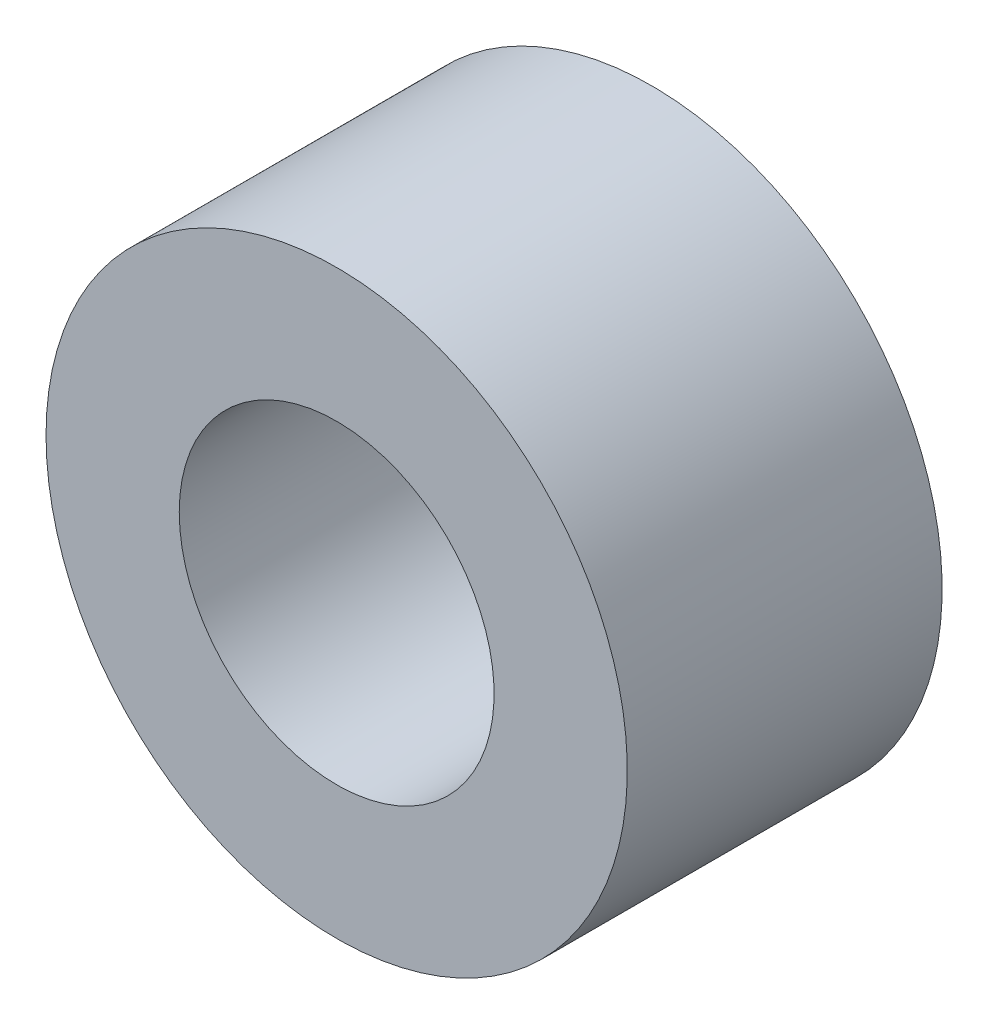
from build123d import *

# Parameters (mm, degrees)
ESQUISSE1_R      = 6
ESQUISSE1_R_2    = 3.25
EXTRUSION1_DEPTH = 6.5


with BuildPart() as part:
    # Esquisse1 → Extrusion1 (new body)
    with BuildSketch(Plane.XY):
        with Locations(Location((0, 0, 0), (0, 0, 180))):
            Circle(ESQUISSE1_R)
        with Locations(Location((0, 0, 0), (0, 0, 180))):
            Circle(ESQUISSE1_R_2, mode=Mode.SUBTRACT)
    extrude(amount=EXTRUSION1_DEPTH)


solid = part.part
